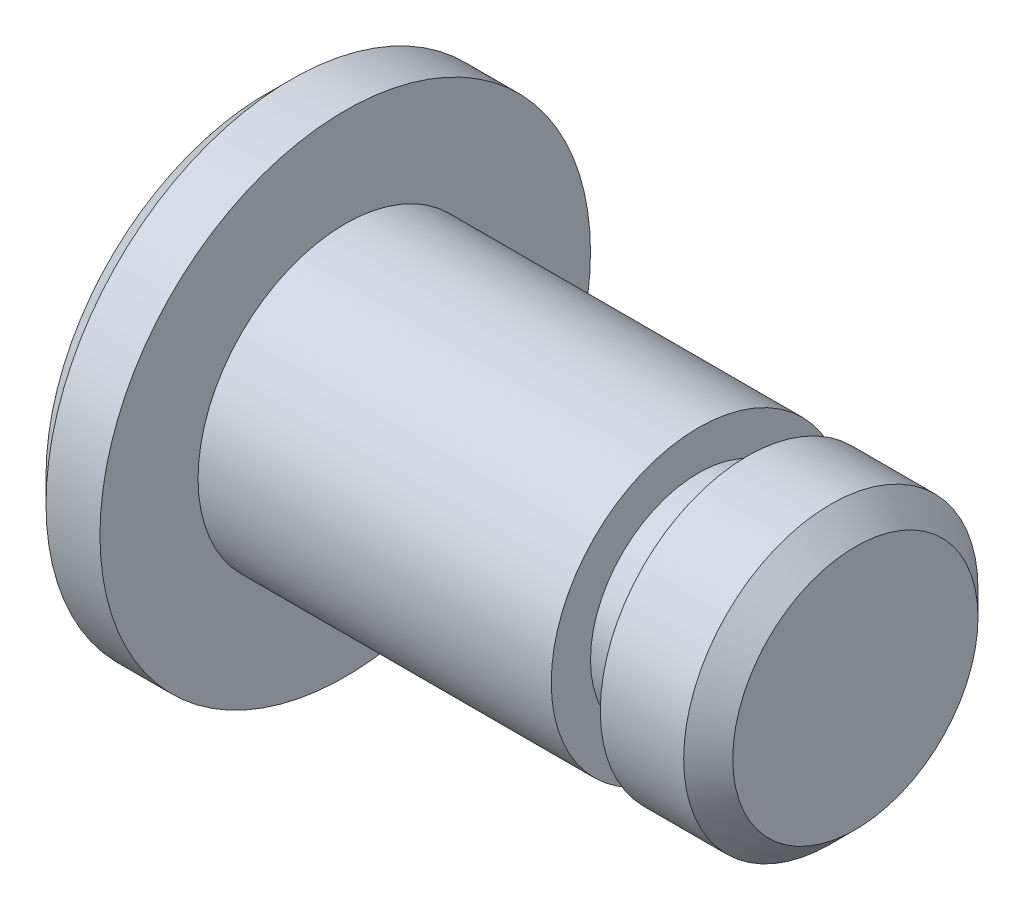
from build123d import *

# Parameters (mm, degrees)
CHANFREIN1_SIZE = 0.25
ESQUISSE2_W     = 0.5
ESQUISSE2_H     = 3.9


with BuildPart() as part:
    # Esquisse1 → Base-R_volution (revolve)
    with BuildSketch(Plane.XY, mode=Mode.PRIVATE) as base_r_volution_sk:
        Polygon((0, 1.5), (0, 2.5), (-0.8, 2.5), (-0.8, 0), (5.2, 0), (5.2, 1.5), align=None)
    revolve(base_r_volution_sk.sketch.rotate(Axis((-30.301126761, 0, 0), (1, 0, 0)), 90), axis=Axis((-30.301126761, 0, 0), (1, 0, 0)))

    # Chanfrein1
    chanfrein1_edges = [part.edges().sort_by_distance(p)[0] for p in [
        (-0.8, 0, -2.5),
        (5.2, 0, -1.5),
    ]]
    chamfer(chanfrein1_edges, length=CHANFREIN1_SIZE)

    # Esquisse2 → Enl_vement de mati_re-R_volution1 (revolve, cut)
    with BuildSketch(Plane.XY, mode=Mode.PRIVATE) as enl_vement_de_mati_re_r_volution1_sk:
        with Locations((3.85, 3.05)):
            Rectangle(ESQUISSE2_W, ESQUISSE2_H)
    revolve(enl_vement_de_mati_re_r_volution1_sk.sketch.rotate(Axis((0, 0, 0), (1, 0, 0)), 90), axis=Axis((0, 0, 0), (1, 0, 0)), mode=Mode.SUBTRACT)


solid = part.part
